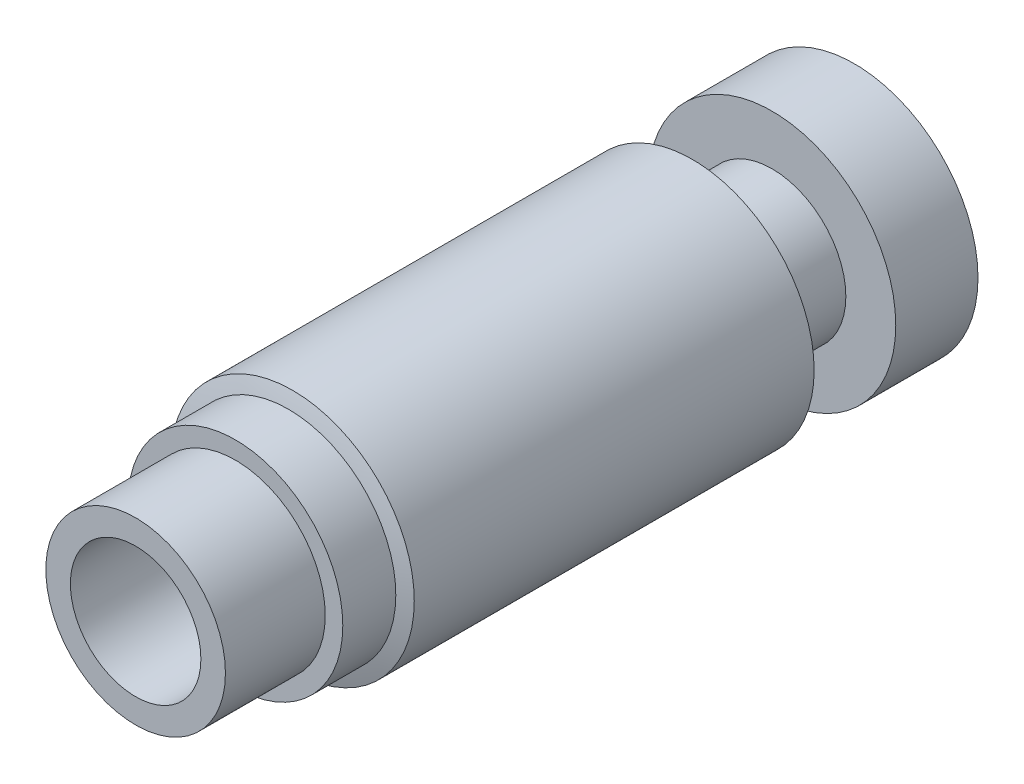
ISO-10303-21;
HEADER;
FILE_DESCRIPTION(('STEP AP214'),'2;1');
FILE_NAME('part.step','',(''),(''),'','','');
FILE_SCHEMA(('AUTOMOTIVE_DESIGN { 1 0 10303 214 1 1 1 1 }'));
ENDSEC;
DATA;
#1=APPLICATION_CONTEXT('core data for automotive mechanical design processes');
#2=APPLICATION_PROTOCOL_DEFINITION('international standard','automotive_design',2000,#1);
#3=PRODUCT_CONTEXT('',#1,'mechanical');
#4=PRODUCT('Part','Part','',(#3));
#5=PRODUCT_RELATED_PRODUCT_CATEGORY('part','',(#4));
#6=PRODUCT_DEFINITION_FORMATION('','',#4);
#7=PRODUCT_DEFINITION_CONTEXT('part definition',#1,'design');
#8=PRODUCT_DEFINITION('design','',#6,#7);
#9=PRODUCT_DEFINITION_SHAPE('','',#8);
#10=(LENGTH_UNIT() NAMED_UNIT(*) SI_UNIT(.MILLI.,.METRE.));
#11=(NAMED_UNIT(*) PLANE_ANGLE_UNIT() SI_UNIT($,.RADIAN.));
#12=(NAMED_UNIT(*) SI_UNIT($,.STERADIAN.) SOLID_ANGLE_UNIT());
#13=UNCERTAINTY_MEASURE_WITH_UNIT(LENGTH_MEASURE(1.E-05),#10,'distance_accuracy_value','');
#14=(GEOMETRIC_REPRESENTATION_CONTEXT(3) GLOBAL_UNCERTAINTY_ASSIGNED_CONTEXT((#13)) GLOBAL_UNIT_ASSIGNED_CONTEXT((#10,
#11,#12)) REPRESENTATION_CONTEXT('',''));
#15=CARTESIAN_POINT('',(0.,0.,0.));
#16=DIRECTION('',(0.,0.,1.));
#17=DIRECTION('',(1.,0.,0.));
#18=AXIS2_PLACEMENT_3D('',#15,#16,#17);
#19=CARTESIAN_POINT('',(0.,0.,-75.0333843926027));
#20=DIRECTION('',(0.,0.,-1.));
#21=DIRECTION('',(-1.,0.,0.));
#22=AXIS2_PLACEMENT_3D('',#19,#20,#21);
#23=PLANE('',#22);
#24=CARTESIAN_POINT('',(0.,0.,-75.0333843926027));
#25=DIRECTION('',(0.,0.,-1.));
#26=DIRECTION('',(-1.,0.,0.));
#27=AXIS2_PLACEMENT_3D('',#24,#25,#26);
#28=CIRCLE('',#27,16.002);
#29=CARTESIAN_POINT('',(-16.002,0.,-75.0333843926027));
#30=VERTEX_POINT('',#29);
#31=EDGE_CURVE('E54',#30,#30,#28,.T.);
#32=ORIENTED_EDGE('',*,*,#31,.T.);
#33=EDGE_LOOP('',(#32));
#34=FACE_BOUND('',#33,.T.);
#35=CARTESIAN_POINT('',(0.,0.,-75.0333843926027));
#36=DIRECTION('',(0.,0.,1.));
#37=DIRECTION('',(1.,0.,0.));
#38=AXIS2_PLACEMENT_3D('',#35,#36,#37);
#39=CIRCLE('',#38,8.44347677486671);
#40=CARTESIAN_POINT('',(8.44347677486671,0.,-75.0333843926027));
#41=VERTEX_POINT('',#40);
#42=EDGE_CURVE('E72',#41,#41,#39,.T.);
#43=ORIENTED_EDGE('',*,*,#42,.T.);
#44=EDGE_LOOP('',(#43));
#45=FACE_BOUND('',#44,.T.);
#46=ADVANCED_FACE('F34',(#34,#45),#23,.T.);
#47=CARTESIAN_POINT('',(0.,0.,17.9561880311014));
#48=DIRECTION('',(0.,0.,1.));
#49=DIRECTION('',(1.,0.,0.));
#50=AXIS2_PLACEMENT_3D('',#47,#48,#49);
#51=PLANE('',#50);
#52=CARTESIAN_POINT('',(0.,0.,17.9561880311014));
#53=DIRECTION('',(0.,0.,1.));
#54=DIRECTION('',(1.,0.,0.));
#55=AXIS2_PLACEMENT_3D('',#52,#53,#54);
#56=CIRCLE('',#55,11.6184767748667);
#57=CARTESIAN_POINT('',(11.6184767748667,0.,17.9561880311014));
#58=VERTEX_POINT('',#57);
#59=EDGE_CURVE('E66',#58,#58,#56,.T.);
#60=ORIENTED_EDGE('',*,*,#59,.T.);
#61=EDGE_LOOP('',(#60));
#62=FACE_BOUND('',#61,.T.);
#63=CARTESIAN_POINT('',(0.,0.,17.9561880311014));
#64=DIRECTION('',(0.,0.,1.));
#65=DIRECTION('',(1.,0.,0.));
#66=AXIS2_PLACEMENT_3D('',#63,#64,#65);
#67=CIRCLE('',#66,8.44347677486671);
#68=CARTESIAN_POINT('',(8.44347677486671,0.,17.9561880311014));
#69=VERTEX_POINT('',#68);
#70=EDGE_CURVE('E38',#69,#69,#67,.F.);
#71=ORIENTED_EDGE('',*,*,#70,.T.);
#72=EDGE_LOOP('',(#71));
#73=FACE_BOUND('',#72,.T.);
#74=ADVANCED_FACE('F79',(#62,#73),#51,.T.);
#75=CARTESIAN_POINT('',(0.,0.,5.04214654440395));
#76=DIRECTION('',(0.,0.,1.));
#77=DIRECTION('',(1.,0.,0.));
#78=AXIS2_PLACEMENT_3D('',#75,#76,#77);
#79=PLANE('',#78);
#80=CARTESIAN_POINT('',(0.,0.,5.04214654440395));
#81=DIRECTION('',(0.,0.,1.));
#82=DIRECTION('',(1.,0.,0.));
#83=AXIS2_PLACEMENT_3D('',#80,#81,#82);
#84=CIRCLE('',#83,13.8897120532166);
#85=CARTESIAN_POINT('',(13.8897120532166,0.,5.04214654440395));
#86=VERTEX_POINT('',#85);
#87=EDGE_CURVE('E63',#86,#86,#84,.T.);
#88=ORIENTED_EDGE('',*,*,#87,.T.);
#89=EDGE_LOOP('',(#88));
#90=FACE_BOUND('',#89,.T.);
#91=CARTESIAN_POINT('',(0.,0.,5.04214654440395));
#92=DIRECTION('',(0.,0.,1.));
#93=DIRECTION('',(1.,0.,0.));
#94=AXIS2_PLACEMENT_3D('',#91,#92,#93);
#95=CIRCLE('',#94,11.6184767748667);
#96=CARTESIAN_POINT('',(11.6184767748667,0.,5.04214654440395));
#97=VERTEX_POINT('',#96);
#98=EDGE_CURVE('E67',#97,#97,#95,.T.);
#99=ORIENTED_EDGE('',*,*,#98,.F.);
#100=EDGE_LOOP('',(#99));
#101=FACE_BOUND('',#100,.T.);
#102=ADVANCED_FACE('F99',(#90,#101),#79,.T.);
#103=CARTESIAN_POINT('',(0.,0.,-53.9892590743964));
#104=DIRECTION('',(0.,0.,1.));
#105=DIRECTION('',(0.,1.,0.));
#106=AXIS2_PLACEMENT_3D('',#103,#104,#105);
#107=SPHERICAL_SURFACE('',#106,53.9892590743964);
#108=CARTESIAN_POINT('',(0.,0.,-1.81727430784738));
#109=DIRECTION('',(0.,0.,-1.));
#110=DIRECTION('',(-1.,0.,0.));
#111=AXIS2_PLACEMENT_3D('',#108,#109,#110);
#112=CIRCLE('',#111,13.8897120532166);
#113=CARTESIAN_POINT('',(0.,13.8897120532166,-1.81727430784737));
#114=VERTEX_POINT('',#113);
#115=EDGE_CURVE('E58',#114,#114,#112,.F.);
#116=CARTESIAN_POINT('',(0.,0.,-2.3477971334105));
#117=DIRECTION('',(0.,0.,1.));
#118=DIRECTION('',(1.,0.,0.));
#119=AXIS2_PLACEMENT_3D('',#116,#117,#118);
#120=CIRCLE('',#119,15.748);
#121=CARTESIAN_POINT('',(0.,15.748,-2.34779713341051));
#122=VERTEX_POINT('',#121);
#123=EDGE_CURVE('E10',#122,#122,#120,.T.);
#124=CARTESIAN_POINT('',(0.,13.8897120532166,-1.81727430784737));
#125=CARTESIAN_POINT('',(0.,13.9091660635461,-1.82245353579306));
#126=CARTESIAN_POINT('',(0.,13.9286171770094,-1.82764364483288));
#127=CARTESIAN_POINT('',(0.,13.9675135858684,-1.83804561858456));
#128=CARTESIAN_POINT('',(0.,13.9869588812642,-1.84325748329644));
#129=CARTESIAN_POINT('',(0.,14.0258436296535,-1.85370296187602));
#130=CARTESIAN_POINT('',(0.,14.0452830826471,-1.85893657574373));
#131=CARTESIAN_POINT('',(0.,14.0841561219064,-1.86942554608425));
#132=CARTESIAN_POINT('',(0.,14.1035897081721,-1.87468090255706));
#133=CARTESIAN_POINT('',(0.,14.1424509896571,-1.8852133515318));
#134=CARTESIAN_POINT('',(0.,14.1618786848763,-1.89049044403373));
#135=CARTESIAN_POINT('',(0.,14.200728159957,-1.90106635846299));
#136=CARTESIAN_POINT('',(0.,14.2201499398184,-1.90636518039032));
#137=CARTESIAN_POINT('',(0.,14.2589875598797,-1.91698454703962));
#138=CARTESIAN_POINT('',(0.,14.2784034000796,-1.9223050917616));
#139=CARTESIAN_POINT('',(0.,14.3172291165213,-1.93296789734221));
#140=CARTESIAN_POINT('',(0.,14.3366389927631,-1.93831015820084));
#141=CARTESIAN_POINT('',(0.,14.3754527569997,-1.94901638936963));
#142=CARTESIAN_POINT('',(0.,14.3948566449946,-1.95438035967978));
#143=CARTESIAN_POINT('',(0.,14.4336584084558,-1.96513000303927));
#144=CARTESIAN_POINT('',(0.,14.4530562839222,-1.97051567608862));
#145=CARTESIAN_POINT('',(0.,14.4918459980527,-1.98130871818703));
#146=CARTESIAN_POINT('',(0.,14.5112378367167,-1.98671608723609));
#147=CARTESIAN_POINT('',(0.,14.550015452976,-1.99755251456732));
#148=CARTESIAN_POINT('',(0.,14.5694012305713,-2.00298157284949));
#149=CARTESIAN_POINT('',(0.,14.6081667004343,-2.01386137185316));
#150=CARTESIAN_POINT('',(0.,14.627546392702,-2.01931211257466));
#151=CARTESIAN_POINT('',(0.,14.6662996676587,-2.03023526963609));
#152=CARTESIAN_POINT('',(0.,14.6856732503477,-2.03570768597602));
#153=CARTESIAN_POINT('',(0.,14.7244142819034,-2.04667418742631));
#154=CARTESIAN_POINT('',(0.,14.7437817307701,-2.05216827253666));
#155=CARTESIAN_POINT('',(0.,14.7825104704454,-2.06317810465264));
#156=CARTESIAN_POINT('',(0.,14.801871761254,-2.06869385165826));
#157=CARTESIAN_POINT('',(0.,14.8405881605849,-2.07974700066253));
#158=CARTESIAN_POINT('',(0.,14.8599432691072,-2.08528440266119));
#159=CARTESIAN_POINT('',(0.,14.8986472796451,-2.09638085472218));
#160=CARTESIAN_POINT('',(0.,14.9179961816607,-2.10193990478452));
#161=CARTESIAN_POINT('',(0.,14.9566877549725,-2.11307964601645));
#162=CARTESIAN_POINT('',(0.,14.9760304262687,-2.11866033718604));
#163=CARTESIAN_POINT('',(0.,15.014709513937,-2.12984335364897));
#164=CARTESIAN_POINT('',(0.,15.034045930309,-2.13544567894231));
#165=CARTESIAN_POINT('',(0.,15.0727124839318,-2.14667195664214));
#166=CARTESIAN_POINT('',(0.,15.0920426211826,-2.15229590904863));
#167=CARTESIAN_POINT('',(0.,15.1306965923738,-2.1635654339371));
#168=CARTESIAN_POINT('',(0.,15.1500204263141,-2.16921100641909));
#169=CARTESIAN_POINT('',(0.,15.1886617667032,-2.18052376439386));
#170=CARTESIAN_POINT('',(0.,15.2079792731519,-2.18619094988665));
#171=CARTESIAN_POINT('',(0.,15.2466079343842,-2.19754692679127));
#172=CARTESIAN_POINT('',(0.,15.2659190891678,-2.20323571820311));
#173=CARTESIAN_POINT('',(0.,15.3045350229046,-2.21463489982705));
#174=CARTESIAN_POINT('',(0.,15.3238398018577,-2.22034529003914));
#175=CARTESIAN_POINT('',(0.,15.3624429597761,-2.23178766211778));
#176=CARTESIAN_POINT('',(0.,15.3817413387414,-2.23751964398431));
#177=CARTESIAN_POINT('',(0.,15.4203316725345,-2.24900519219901));
#178=CARTESIAN_POINT('',(0.,15.4396236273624,-2.25475875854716));
#179=CARTESIAN_POINT('',(0.,15.4782010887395,-2.26628746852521));
#180=CARTESIAN_POINT('',(0.,15.4974865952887,-2.2720626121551));
#181=CARTESIAN_POINT('',(0.,15.536051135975,-2.28363446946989));
#182=CARTESIAN_POINT('',(0.,15.5553301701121,-2.28943118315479));
#183=CARTESIAN_POINT('',(0.,15.5938817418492,-2.30104617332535));
#184=CARTESIAN_POINT('',(0.,15.6131542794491,-2.306864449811));
#185=CARTESIAN_POINT('',(0.,15.6516928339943,-2.31852255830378));
#186=CARTESIAN_POINT('',(0.,15.6709588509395,-2.3243623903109));
#187=CARTESIAN_POINT('',(0.,15.709484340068,-2.3360636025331));
#188=CARTESIAN_POINT('',(0.,15.7287438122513,-2.34192498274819));
#189=CARTESIAN_POINT('',(0.,15.748,-2.34779713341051));
#190=B_SPLINE_CURVE_WITH_KNOTS('',3,(#124,#125,#126,#127,#128,#129,#130,#131,#132,#133,#134,
#135,#136,#137,#138,#139,#140,#141,#142,#143,#144,#145,#146,#147,#148,#149,#150,#151,#152,#153,
#154,#155,#156,#157,#158,#159,#160,#161,#162,#163,#164,#165,#166,#167,#168,#169,#170,#171,#172,
#173,#174,#175,#176,#177,#178,#179,#180,#181,#182,#183,#184,#185,#186,#187,#188,#189),
.UNSPECIFIED.,.F.,.F.,(4,2,2,2,2,2,2,2,2,2,2,2,2,2,2,2,2,2,2,2,2,2,2,2,2,2,2,2,2,2,2,2,4),(0.,
0.0603949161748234,0.120789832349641,0.181184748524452,0.241579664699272,0.301974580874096,
0.362369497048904,0.422764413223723,0.483159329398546,0.543554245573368,0.603949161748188,
0.664344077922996,0.724738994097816,0.785133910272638,0.845528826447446,0.905923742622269,
0.966318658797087,1.02671357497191,1.08710849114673,1.14750340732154,1.20789832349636,
1.26829323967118,1.32868815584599,1.38908307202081,1.44947798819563,1.50987290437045,
1.57026782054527,1.63066273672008,1.6910576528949,1.75145256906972,1.81184748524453,
1.87224240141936,1.93263731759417),.UNSPECIFIED.);
#191=EDGE_CURVE('BSEAM36',#114,#122,#190,.T.);
#192=ORIENTED_EDGE('',*,*,#115,.F.);
#193=ORIENTED_EDGE('',*,*,#123,.T.);
#194=ORIENTED_EDGE('',*,*,#191,.T.);
#195=ORIENTED_EDGE('',*,*,#191,.F.);
#196=EDGE_LOOP('',(#192,#194,#193,#195));
#197=FACE_BOUND('',#196,.T.);
#198=ADVANCED_FACE('F36',(#197),#107,.T.);
#199=CARTESIAN_POINT('',(0.,0.,0.));
#200=DIRECTION('',(0.,0.,1.));
#201=DIRECTION('',(1.,0.,0.));
#202=AXIS2_PLACEMENT_3D('',#199,#200,#201);
#203=CYLINDRICAL_SURFACE('',#202,15.748);
#204=ORIENTED_EDGE('',*,*,#123,.F.);
#205=EDGE_LOOP('',(#204));
#206=FACE_BOUND('',#205,.T.);
#207=CARTESIAN_POINT('',(0.,0.,-54.0872671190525));
#208=DIRECTION('',(0.,0.,1.));
#209=DIRECTION('',(1.,0.,0.));
#210=AXIS2_PLACEMENT_3D('',#207,#208,#209);
#211=CIRCLE('',#210,15.748);
#212=CARTESIAN_POINT('',(15.748,0.,-54.0872671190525));
#213=VERTEX_POINT('',#212);
#214=EDGE_CURVE('E42',#213,#213,#211,.T.);
#215=ORIENTED_EDGE('',*,*,#214,.T.);
#216=EDGE_LOOP('',(#215));
#217=FACE_BOUND('',#216,.T.);
#218=ADVANCED_FACE('F118',(#206,#217),#203,.T.);
#219=CARTESIAN_POINT('',(0.,15.748,-54.0872671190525));
#220=DIRECTION('',(0.,0.,1.));
#221=DIRECTION('',(1.,0.,0.));
#222=AXIS2_PLACEMENT_3D('',#219,#220,#221);
#223=PLANE('',#222);
#224=ORIENTED_EDGE('',*,*,#214,.F.);
#225=EDGE_LOOP('',(#224));
#226=FACE_BOUND('',#225,.T.);
#227=CARTESIAN_POINT('',(0.,0.,-54.0872671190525));
#228=DIRECTION('',(0.,0.,1.));
#229=DIRECTION('',(1.,0.,0.));
#230=AXIS2_PLACEMENT_3D('',#227,#228,#229);
#231=CIRCLE('',#230,9.54417416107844);
#232=CARTESIAN_POINT('',(9.54417416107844,0.,-54.0872671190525));
#233=VERTEX_POINT('',#232);
#234=EDGE_CURVE('E46',#233,#233,#231,.T.);
#235=ORIENTED_EDGE('',*,*,#234,.T.);
#236=EDGE_LOOP('',(#235));
#237=FACE_BOUND('',#236,.T.);
#238=ADVANCED_FACE('F115',(#226,#237),#223,.F.);
#239=CARTESIAN_POINT('',(0.,0.,0.));
#240=DIRECTION('',(0.,0.,1.));
#241=DIRECTION('',(1.,0.,0.));
#242=AXIS2_PLACEMENT_3D('',#239,#240,#241);
#243=CYLINDRICAL_SURFACE('',#242,9.54417416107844);
#244=ORIENTED_EDGE('',*,*,#234,.F.);
#245=EDGE_LOOP('',(#244));
#246=FACE_BOUND('',#245,.T.);
#247=CARTESIAN_POINT('',(0.,0.,-64.393254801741));
#248=DIRECTION('',(0.,0.,-1.));
#249=DIRECTION('',(-1.,0.,0.));
#250=AXIS2_PLACEMENT_3D('',#247,#248,#249);
#251=CIRCLE('',#250,9.54417416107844);
#252=CARTESIAN_POINT('',(-9.54417416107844,0.,-64.393254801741));
#253=VERTEX_POINT('',#252);
#254=EDGE_CURVE('E51',#253,#253,#251,.T.);
#255=ORIENTED_EDGE('',*,*,#254,.F.);
#256=EDGE_LOOP('',(#255));
#257=FACE_BOUND('',#256,.T.);
#258=ADVANCED_FACE('F108',(#246,#257),#243,.T.);
#259=CARTESIAN_POINT('',(0.,0.,-64.393254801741));
#260=DIRECTION('',(0.,0.,-1.));
#261=DIRECTION('',(-1.,0.,0.));
#262=AXIS2_PLACEMENT_3D('',#259,#260,#261);
#263=PLANE('',#262);
#264=CARTESIAN_POINT('',(0.,0.,-64.393254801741));
#265=DIRECTION('',(0.,0.,-1.));
#266=DIRECTION('',(-1.,0.,0.));
#267=AXIS2_PLACEMENT_3D('',#264,#265,#266);
#268=CIRCLE('',#267,16.002);
#269=CARTESIAN_POINT('',(-16.002,0.,-64.393254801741));
#270=VERTEX_POINT('',#269);
#271=EDGE_CURVE('E55',#270,#270,#268,.T.);
#272=ORIENTED_EDGE('',*,*,#271,.F.);
#273=EDGE_LOOP('',(#272));
#274=FACE_BOUND('',#273,.T.);
#275=ORIENTED_EDGE('',*,*,#254,.T.);
#276=EDGE_LOOP('',(#275));
#277=FACE_BOUND('',#276,.T.);
#278=ADVANCED_FACE('F104',(#274,#277),#263,.F.);
#279=CARTESIAN_POINT('',(0.,0.,-75.0333843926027));
#280=DIRECTION('',(0.,0.,1.));
#281=DIRECTION('',(1.,0.,0.));
#282=AXIS2_PLACEMENT_3D('',#279,#280,#281);
#283=CYLINDRICAL_SURFACE('',#282,16.002);
#284=ORIENTED_EDGE('',*,*,#31,.F.);
#285=EDGE_LOOP('',(#284));
#286=FACE_BOUND('',#285,.T.);
#287=ORIENTED_EDGE('',*,*,#271,.T.);
#288=EDGE_LOOP('',(#287));
#289=FACE_BOUND('',#288,.T.);
#290=ADVANCED_FACE('F107',(#286,#289),#283,.T.);
#291=CARTESIAN_POINT('',(0.,0.,-500000.));
#292=DIRECTION('',(0.,0.,1.));
#293=DIRECTION('',(1.,0.,0.));
#294=AXIS2_PLACEMENT_3D('',#291,#292,#293);
#295=CYLINDRICAL_SURFACE('',#294,13.8897120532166);
#296=ORIENTED_EDGE('',*,*,#115,.T.);
#297=EDGE_LOOP('',(#296));
#298=FACE_BOUND('',#297,.T.);
#299=ORIENTED_EDGE('',*,*,#87,.F.);
#300=EDGE_LOOP('',(#299));
#301=FACE_BOUND('',#300,.T.);
#302=ADVANCED_FACE('F89',(#298,#301),#295,.T.);
#303=CARTESIAN_POINT('',(0.,0.,17.9561880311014));
#304=DIRECTION('',(0.,0.,-1.));
#305=DIRECTION('',(-1.,0.,0.));
#306=AXIS2_PLACEMENT_3D('',#303,#304,#305);
#307=CYLINDRICAL_SURFACE('',#306,11.6184767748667);
#308=ORIENTED_EDGE('',*,*,#59,.F.);
#309=EDGE_LOOP('',(#308));
#310=FACE_BOUND('',#309,.T.);
#311=ORIENTED_EDGE('',*,*,#98,.T.);
#312=EDGE_LOOP('',(#311));
#313=FACE_BOUND('',#312,.T.);
#314=ADVANCED_FACE('F84',(#310,#313),#307,.T.);
#315=CARTESIAN_POINT('',(0.,0.,28.1161880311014));
#316=DIRECTION('',(0.,0.,-1.));
#317=DIRECTION('',(-1.,0.,0.));
#318=AXIS2_PLACEMENT_3D('',#315,#316,#317);
#319=CYLINDRICAL_SURFACE('',#318,8.44347677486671);
#320=ORIENTED_EDGE('',*,*,#70,.F.);
#321=EDGE_LOOP('',(#320));
#322=FACE_BOUND('',#321,.T.);
#323=ORIENTED_EDGE('',*,*,#42,.F.);
#324=EDGE_LOOP('',(#323));
#325=FACE_BOUND('',#324,.T.);
#326=ADVANCED_FACE('F81',(#322,#325),#319,.F.);
#327=CLOSED_SHELL('',(#46,#74,#102,#198,#218,#238,#258,#278,#290,#302,#314,#326));
#328=MANIFOLD_SOLID_BREP('B2',#327);
#329=ADVANCED_BREP_SHAPE_REPRESENTATION('',(#18,#328),#14);
#330=SHAPE_DEFINITION_REPRESENTATION(#9,#329);
ENDSEC;
END-ISO-10303-21;
